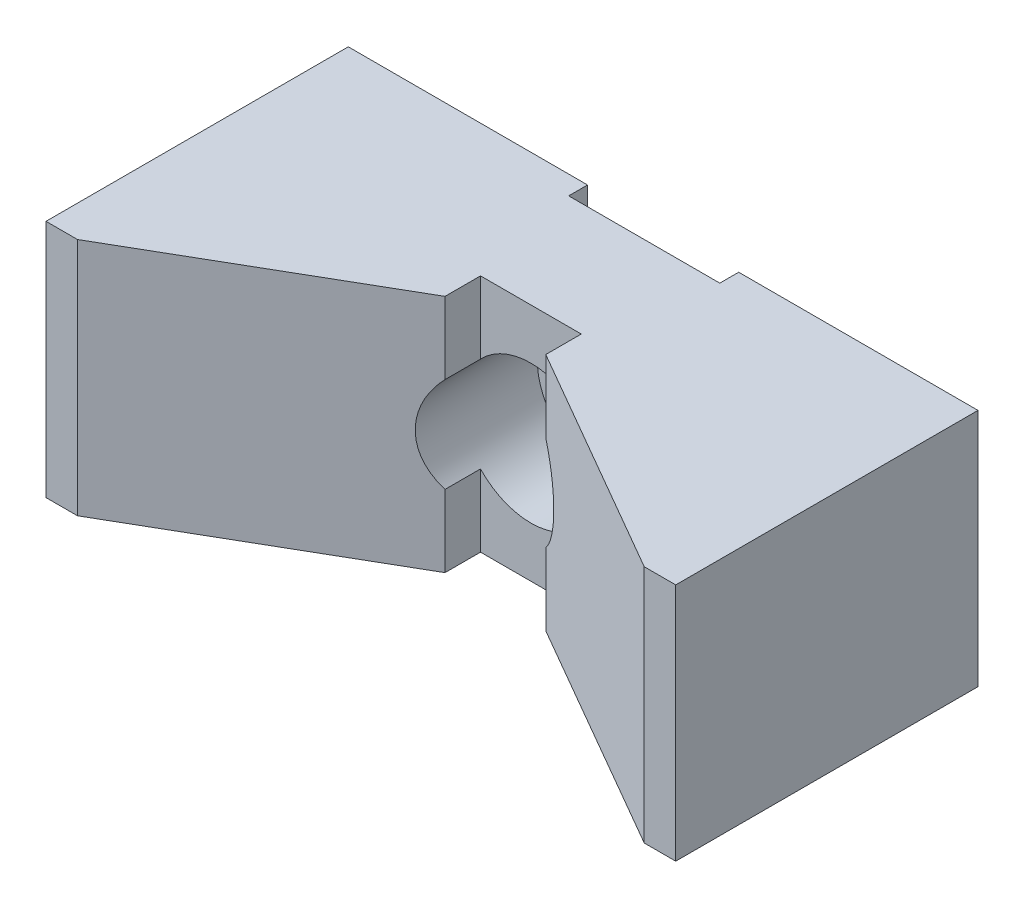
ISO-10303-21;
HEADER;
FILE_DESCRIPTION(('STEP AP214'),'2;1');
FILE_NAME('part.step','',(''),(''),'','','');
FILE_SCHEMA(('AUTOMOTIVE_DESIGN { 1 0 10303 214 1 1 1 1 }'));
ENDSEC;
DATA;
#1=APPLICATION_CONTEXT('core data for automotive mechanical design processes');
#2=APPLICATION_PROTOCOL_DEFINITION('international standard','automotive_design',2000,#1);
#3=PRODUCT_CONTEXT('',#1,'mechanical');
#4=PRODUCT('Part','Part','',(#3));
#5=PRODUCT_RELATED_PRODUCT_CATEGORY('part','',(#4));
#6=PRODUCT_DEFINITION_FORMATION('','',#4);
#7=PRODUCT_DEFINITION_CONTEXT('part definition',#1,'design');
#8=PRODUCT_DEFINITION('design','',#6,#7);
#9=PRODUCT_DEFINITION_SHAPE('','',#8);
#10=(LENGTH_UNIT() NAMED_UNIT(*) SI_UNIT(.MILLI.,.METRE.));
#11=(NAMED_UNIT(*) PLANE_ANGLE_UNIT() SI_UNIT($,.RADIAN.));
#12=(NAMED_UNIT(*) SI_UNIT($,.STERADIAN.) SOLID_ANGLE_UNIT());
#13=UNCERTAINTY_MEASURE_WITH_UNIT(LENGTH_MEASURE(1.E-05),#10,'distance_accuracy_value','');
#14=(GEOMETRIC_REPRESENTATION_CONTEXT(3) GLOBAL_UNCERTAINTY_ASSIGNED_CONTEXT((#13)) GLOBAL_UNIT_ASSIGNED_CONTEXT((#10,
#11,#12)) REPRESENTATION_CONTEXT('',''));
#15=CARTESIAN_POINT('',(0.,0.,0.));
#16=DIRECTION('',(0.,0.,1.));
#17=DIRECTION('',(1.,0.,0.));
#18=AXIS2_PLACEMENT_3D('',#15,#16,#17);
#19=CARTESIAN_POINT('',(-25.,-9.5,0.));
#20=DIRECTION('',(0.,0.,1.));
#21=DIRECTION('',(-1.,0.,0.));
#22=AXIS2_PLACEMENT_3D('',#19,#20,#21);
#23=PLANE('',#22);
#24=DIRECTION('',(1.,0.,0.));
#25=VECTOR('',#24,1.);
#26=CARTESIAN_POINT('',(-25.,-9.5,0.));
#27=LINE('',#26,#25);
#28=CARTESIAN_POINT('',(6.,-9.5,0.));
#29=VERTEX_POINT('',#28);
#30=CARTESIAN_POINT('',(25.,-9.5,0.));
#31=VERTEX_POINT('',#30);
#32=EDGE_CURVE('E238',#29,#31,#27,.T.);
#33=ORIENTED_EDGE('',*,*,#32,.F.);
#34=DIRECTION('',(0.,-1.,0.));
#35=VECTOR('',#34,1.);
#36=CARTESIAN_POINT('',(6.,29.5,0.));
#37=LINE('',#36,#35);
#38=CARTESIAN_POINT('',(6.,9.5,0.));
#39=VERTEX_POINT('',#38);
#40=EDGE_CURVE('E189',#39,#29,#37,.T.);
#41=ORIENTED_EDGE('',*,*,#40,.F.);
#42=DIRECTION('',(1.,0.,0.));
#43=VECTOR('',#42,1.);
#44=CARTESIAN_POINT('',(-25.,9.5,0.));
#45=LINE('',#44,#43);
#46=CARTESIAN_POINT('',(25.,9.5,0.));
#47=VERTEX_POINT('',#46);
#48=EDGE_CURVE('E222',#39,#47,#45,.T.);
#49=ORIENTED_EDGE('',*,*,#48,.T.);
#50=DIRECTION('',(0.,1.,0.));
#51=VECTOR('',#50,1.);
#52=CARTESIAN_POINT('',(25.,-9.5,0.));
#53=LINE('',#52,#51);
#54=EDGE_CURVE('E242',#31,#47,#53,.T.);
#55=ORIENTED_EDGE('',*,*,#54,.F.);
#56=EDGE_LOOP('',(#33,#41,#49,#55));
#57=FACE_BOUND('',#56,.T.);
#58=ADVANCED_FACE('F14',(#57),#23,.F.);
#59=CARTESIAN_POINT('',(25.,-9.5,0.));
#60=DIRECTION('',(-1.,0.,0.));
#61=DIRECTION('',(0.,0.,-1.));
#62=AXIS2_PLACEMENT_3D('',#59,#60,#61);
#63=PLANE('',#62);
#64=DIRECTION('',(0.,0.,1.));
#65=VECTOR('',#64,1.);
#66=CARTESIAN_POINT('',(25.,9.5,0.));
#67=LINE('',#66,#65);
#68=CARTESIAN_POINT('',(25.,9.5,24.));
#69=VERTEX_POINT('',#68);
#70=EDGE_CURVE('E208',#47,#69,#67,.T.);
#71=ORIENTED_EDGE('',*,*,#70,.T.);
#72=DIRECTION('',(0.,1.,0.));
#73=VECTOR('',#72,1.);
#74=CARTESIAN_POINT('',(25.,-9.5,24.));
#75=LINE('',#74,#73);
#76=CARTESIAN_POINT('',(25.,-9.5,24.));
#77=VERTEX_POINT('',#76);
#78=EDGE_CURVE('E257',#77,#69,#75,.T.);
#79=ORIENTED_EDGE('',*,*,#78,.F.);
#80=DIRECTION('',(0.,0.,1.));
#81=VECTOR('',#80,1.);
#82=CARTESIAN_POINT('',(25.,-9.5,0.));
#83=LINE('',#82,#81);
#84=EDGE_CURVE('E226',#31,#77,#83,.T.);
#85=ORIENTED_EDGE('',*,*,#84,.F.);
#86=ORIENTED_EDGE('',*,*,#54,.T.);
#87=EDGE_LOOP('',(#71,#79,#85,#86));
#88=FACE_BOUND('',#87,.T.);
#89=ADVANCED_FACE('F16',(#88),#63,.F.);
#90=CARTESIAN_POINT('',(25.,-9.5,24.));
#91=DIRECTION('',(0.,0.,-1.));
#92=DIRECTION('',(1.,0.,0.));
#93=AXIS2_PLACEMENT_3D('',#90,#91,#92);
#94=PLANE('',#93);
#95=DIRECTION('',(-1.,0.,0.));
#96=VECTOR('',#95,1.);
#97=CARTESIAN_POINT('',(25.,9.5,24.));
#98=LINE('',#97,#96);
#99=CARTESIAN_POINT('',(22.5,9.5,24.));
#100=VERTEX_POINT('',#99);
#101=EDGE_CURVE('E211',#69,#100,#98,.T.);
#102=ORIENTED_EDGE('',*,*,#101,.T.);
#103=DIRECTION('',(0.,1.,0.));
#104=VECTOR('',#103,1.);
#105=CARTESIAN_POINT('',(22.5,-9.5,24.));
#106=LINE('',#105,#104);
#107=CARTESIAN_POINT('',(22.5,-9.5,24.));
#108=VERTEX_POINT('',#107);
#109=EDGE_CURVE('E254',#108,#100,#106,.T.);
#110=ORIENTED_EDGE('',*,*,#109,.F.);
#111=DIRECTION('',(-1.,0.,0.));
#112=VECTOR('',#111,1.);
#113=CARTESIAN_POINT('',(25.,-9.5,24.));
#114=LINE('',#113,#112);
#115=EDGE_CURVE('E229',#77,#108,#114,.T.);
#116=ORIENTED_EDGE('',*,*,#115,.F.);
#117=ORIENTED_EDGE('',*,*,#78,.T.);
#118=EDGE_LOOP('',(#102,#110,#116,#117));
#119=FACE_BOUND('',#118,.T.);
#120=ADVANCED_FACE('F330',(#119),#94,.F.);
#121=CARTESIAN_POINT('',(22.5,-9.5,24.));
#122=DIRECTION('',(0.5,0.,-0.86602540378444));
#123=DIRECTION('',(0.86602540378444,0.,0.5));
#124=AXIS2_PLACEMENT_3D('',#121,#122,#123);
#125=PLANE('',#124);
#126=DIRECTION('',(-0.86602540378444,0.,-0.5));
#127=VECTOR('',#126,1.);
#128=CARTESIAN_POINT('',(22.5,9.5,24.));
#129=LINE('',#128,#127);
#130=CARTESIAN_POINT('',(4.,9.5,13.319020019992));
#131=VERTEX_POINT('',#130);
#132=EDGE_CURVE('E213',#100,#131,#129,.T.);
#133=ORIENTED_EDGE('',*,*,#132,.T.);
#134=DIRECTION('',(0.,-1.,0.));
#135=VECTOR('',#134,1.);
#136=CARTESIAN_POINT('',(4.,-9.5,13.319020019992));
#137=LINE('',#136,#135);
#138=CARTESIAN_POINT('',(4.,3.77491721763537,13.319020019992));
#139=VERTEX_POINT('',#138);
#140=EDGE_CURVE('E165',#131,#139,#137,.T.);
#141=ORIENTED_EDGE('',*,*,#140,.T.);
#142=CARTESIAN_POINT('',(0.,0.,11.0096189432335));
#143=DIRECTION('',(0.5,0.,-0.86602540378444));
#144=DIRECTION('',(-0.86602540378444,0.,-0.5));
#145=AXIS2_PLACEMENT_3D('',#142,#143,#144);
#146=ELLIPSE('',#145,6.35085296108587,5.5);
#147=CARTESIAN_POINT('',(4.,-3.77491721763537,13.319020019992));
#148=VERTEX_POINT('',#147);
#149=EDGE_CURVE('E185',#139,#148,#146,.T.);
#150=ORIENTED_EDGE('',*,*,#149,.T.);
#151=CARTESIAN_POINT('',(4.,-9.5,13.319020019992));
#152=VERTEX_POINT('',#151);
#153=EDGE_CURVE('E37',#148,#152,#137,.T.);
#154=ORIENTED_EDGE('',*,*,#153,.T.);
#155=DIRECTION('',(-0.86602540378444,0.,-0.5));
#156=VECTOR('',#155,1.);
#157=CARTESIAN_POINT('',(22.5,-9.5,24.));
#158=LINE('',#157,#156);
#159=EDGE_CURVE('E159',#108,#152,#158,.T.);
#160=ORIENTED_EDGE('',*,*,#159,.F.);
#161=ORIENTED_EDGE('',*,*,#109,.T.);
#162=EDGE_LOOP('',(#133,#141,#150,#154,#160,#161));
#163=FACE_BOUND('',#162,.T.);
#164=ADVANCED_FACE('F333',(#163),#125,.F.);
#165=CARTESIAN_POINT('',(-22.5,-9.5,24.));
#166=DIRECTION('',(-0.5,0.,-0.86602540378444));
#167=DIRECTION('',(0.86602540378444,0.,-0.5));
#168=AXIS2_PLACEMENT_3D('',#165,#166,#167);
#169=PLANE('',#168);
#170=DIRECTION('',(-0.86602540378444,0.,0.5));
#171=VECTOR('',#170,1.);
#172=CARTESIAN_POINT('',(-22.5,-9.5,24.));
#173=LINE('',#172,#171);
#174=CARTESIAN_POINT('',(-4.,-9.5,13.319020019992));
#175=VERTEX_POINT('',#174);
#176=CARTESIAN_POINT('',(-22.5,-9.5,24.));
#177=VERTEX_POINT('',#176);
#178=EDGE_CURVE('E232',#175,#177,#173,.T.);
#179=ORIENTED_EDGE('',*,*,#178,.F.);
#180=DIRECTION('',(0.,1.,0.));
#181=VECTOR('',#180,1.);
#182=CARTESIAN_POINT('',(-4.,-9.5,13.319020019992));
#183=LINE('',#182,#181);
#184=CARTESIAN_POINT('',(-4.,-3.77491721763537,13.319020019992));
#185=VERTEX_POINT('',#184);
#186=EDGE_CURVE('E170',#175,#185,#183,.T.);
#187=ORIENTED_EDGE('',*,*,#186,.T.);
#188=CARTESIAN_POINT('',(0.,0.,11.0096189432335));
#189=DIRECTION('',(-0.5,0.,-0.86602540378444));
#190=DIRECTION('',(0.86602540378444,0.,-0.5));
#191=AXIS2_PLACEMENT_3D('',#188,#189,#190);
#192=ELLIPSE('',#191,6.35085296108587,5.5);
#193=CARTESIAN_POINT('',(-4.,3.77491721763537,13.319020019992));
#194=VERTEX_POINT('',#193);
#195=EDGE_CURVE('E267',#185,#194,#192,.T.);
#196=ORIENTED_EDGE('',*,*,#195,.T.);
#197=CARTESIAN_POINT('',(-4.,9.5,13.319020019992));
#198=VERTEX_POINT('',#197);
#199=EDGE_CURVE('E173',#194,#198,#183,.T.);
#200=ORIENTED_EDGE('',*,*,#199,.T.);
#201=DIRECTION('',(-0.86602540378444,0.,0.5));
#202=VECTOR('',#201,1.);
#203=CARTESIAN_POINT('',(-22.5,9.5,24.));
#204=LINE('',#203,#202);
#205=CARTESIAN_POINT('',(-22.5,9.5,24.));
#206=VERTEX_POINT('',#205);
#207=EDGE_CURVE('E216',#198,#206,#204,.T.);
#208=ORIENTED_EDGE('',*,*,#207,.T.);
#209=DIRECTION('',(0.,1.,0.));
#210=VECTOR('',#209,1.);
#211=CARTESIAN_POINT('',(-22.5,-9.5,24.));
#212=LINE('',#211,#210);
#213=EDGE_CURVE('E251',#177,#206,#212,.T.);
#214=ORIENTED_EDGE('',*,*,#213,.F.);
#215=EDGE_LOOP('',(#179,#187,#196,#200,#208,#214));
#216=FACE_BOUND('',#215,.T.);
#217=ADVANCED_FACE('F289',(#216),#169,.F.);
#218=CARTESIAN_POINT('',(-25.,-9.5,24.));
#219=DIRECTION('',(0.,0.,-1.));
#220=DIRECTION('',(1.,0.,0.));
#221=AXIS2_PLACEMENT_3D('',#218,#219,#220);
#222=PLANE('',#221);
#223=DIRECTION('',(-1.,0.,0.));
#224=VECTOR('',#223,1.);
#225=CARTESIAN_POINT('',(-25.,9.5,24.));
#226=LINE('',#225,#224);
#227=CARTESIAN_POINT('',(-25.,9.5,24.));
#228=VERTEX_POINT('',#227);
#229=EDGE_CURVE('E218',#206,#228,#226,.T.);
#230=ORIENTED_EDGE('',*,*,#229,.T.);
#231=DIRECTION('',(0.,1.,0.));
#232=VECTOR('',#231,1.);
#233=CARTESIAN_POINT('',(-25.,-9.5,24.));
#234=LINE('',#233,#232);
#235=CARTESIAN_POINT('',(-25.,-9.5,24.));
#236=VERTEX_POINT('',#235);
#237=EDGE_CURVE('E248',#236,#228,#234,.T.);
#238=ORIENTED_EDGE('',*,*,#237,.F.);
#239=DIRECTION('',(-1.,0.,0.));
#240=VECTOR('',#239,1.);
#241=CARTESIAN_POINT('',(-25.,-9.5,24.));
#242=LINE('',#241,#240);
#243=EDGE_CURVE('E234',#177,#236,#242,.T.);
#244=ORIENTED_EDGE('',*,*,#243,.F.);
#245=ORIENTED_EDGE('',*,*,#213,.T.);
#246=EDGE_LOOP('',(#230,#238,#244,#245));
#247=FACE_BOUND('',#246,.T.);
#248=ADVANCED_FACE('F296',(#247),#222,.F.);
#249=CARTESIAN_POINT('',(-25.,-9.5,0.));
#250=DIRECTION('',(1.,0.,0.));
#251=DIRECTION('',(0.,0.,1.));
#252=AXIS2_PLACEMENT_3D('',#249,#250,#251);
#253=PLANE('',#252);
#254=DIRECTION('',(0.,0.,-1.));
#255=VECTOR('',#254,1.);
#256=CARTESIAN_POINT('',(-25.,9.5,0.));
#257=LINE('',#256,#255);
#258=CARTESIAN_POINT('',(-25.,9.5,0.));
#259=VERTEX_POINT('',#258);
#260=EDGE_CURVE('E220',#228,#259,#257,.T.);
#261=ORIENTED_EDGE('',*,*,#260,.T.);
#262=DIRECTION('',(0.,1.,0.));
#263=VECTOR('',#262,1.);
#264=CARTESIAN_POINT('',(-25.,-9.5,0.));
#265=LINE('',#264,#263);
#266=CARTESIAN_POINT('',(-25.,-9.5,0.));
#267=VERTEX_POINT('',#266);
#268=EDGE_CURVE('E245',#267,#259,#265,.T.);
#269=ORIENTED_EDGE('',*,*,#268,.F.);
#270=DIRECTION('',(0.,0.,-1.));
#271=VECTOR('',#270,1.);
#272=CARTESIAN_POINT('',(-25.,-9.5,0.));
#273=LINE('',#272,#271);
#274=EDGE_CURVE('E236',#236,#267,#273,.T.);
#275=ORIENTED_EDGE('',*,*,#274,.F.);
#276=ORIENTED_EDGE('',*,*,#237,.T.);
#277=EDGE_LOOP('',(#261,#269,#275,#276));
#278=FACE_BOUND('',#277,.T.);
#279=ADVANCED_FACE('F301',(#278),#253,.F.);
#280=CARTESIAN_POINT('',(-6.,9.5,0.));
#281=VERTEX_POINT('',#280);
#282=EDGE_CURVE('E223',#259,#281,#45,.T.);
#283=ORIENTED_EDGE('',*,*,#282,.T.);
#284=DIRECTION('',(0.,-1.,0.));
#285=VECTOR('',#284,1.);
#286=CARTESIAN_POINT('',(-6.,29.5,0.));
#287=LINE('',#286,#285);
#288=CARTESIAN_POINT('',(-6.,-9.5,0.));
#289=VERTEX_POINT('',#288);
#290=EDGE_CURVE('E192',#281,#289,#287,.T.);
#291=ORIENTED_EDGE('',*,*,#290,.T.);
#292=EDGE_CURVE('E239',#267,#289,#27,.T.);
#293=ORIENTED_EDGE('',*,*,#292,.F.);
#294=ORIENTED_EDGE('',*,*,#268,.T.);
#295=EDGE_LOOP('',(#283,#291,#293,#294));
#296=FACE_BOUND('',#295,.T.);
#297=ADVANCED_FACE('F305',(#296),#23,.F.);
#298=CARTESIAN_POINT('',(25.,-9.5,0.));
#299=DIRECTION('',(0.,1.,0.));
#300=DIRECTION('',(1.,0.,0.));
#301=AXIS2_PLACEMENT_3D('',#298,#299,#300);
#302=PLANE('',#301);
#303=DIRECTION('',(1.,0.,0.));
#304=VECTOR('',#303,1.);
#305=CARTESIAN_POINT('',(4.,-9.5,10.5));
#306=LINE('',#305,#304);
#307=CARTESIAN_POINT('',(-4.,-9.5,10.5));
#308=VERTEX_POINT('',#307);
#309=CARTESIAN_POINT('',(4.,-9.5,10.5));
#310=VERTEX_POINT('',#309);
#311=EDGE_CURVE('E148',#308,#310,#306,.T.);
#312=ORIENTED_EDGE('',*,*,#311,.F.);
#313=DIRECTION('',(0.,0.,-1.));
#314=VECTOR('',#313,1.);
#315=CARTESIAN_POINT('',(-4.,-9.5,10.5));
#316=LINE('',#315,#314);
#317=EDGE_CURVE('E145',#175,#308,#316,.T.);
#318=ORIENTED_EDGE('',*,*,#317,.F.);
#319=ORIENTED_EDGE('',*,*,#178,.T.);
#320=ORIENTED_EDGE('',*,*,#243,.T.);
#321=ORIENTED_EDGE('',*,*,#274,.T.);
#322=ORIENTED_EDGE('',*,*,#292,.T.);
#323=DIRECTION('',(0.,0.,1.));
#324=VECTOR('',#323,1.);
#325=CARTESIAN_POINT('',(-6.,-9.5,0.));
#326=LINE('',#325,#324);
#327=CARTESIAN_POINT('',(-6.,-9.5,1.5));
#328=VERTEX_POINT('',#327);
#329=EDGE_CURVE('E202',#289,#328,#326,.T.);
#330=ORIENTED_EDGE('',*,*,#329,.T.);
#331=DIRECTION('',(1.,0.,0.));
#332=VECTOR('',#331,1.);
#333=CARTESIAN_POINT('',(25.,-9.5,1.5));
#334=LINE('',#333,#332);
#335=CARTESIAN_POINT('',(6.,-9.5,1.5));
#336=VERTEX_POINT('',#335);
#337=EDGE_CURVE('E191',#328,#336,#334,.T.);
#338=ORIENTED_EDGE('',*,*,#337,.T.);
#339=DIRECTION('',(0.,0.,-1.));
#340=VECTOR('',#339,1.);
#341=CARTESIAN_POINT('',(6.,-9.5,0.));
#342=LINE('',#341,#340);
#343=EDGE_CURVE('E205',#336,#29,#342,.T.);
#344=ORIENTED_EDGE('',*,*,#343,.T.);
#345=ORIENTED_EDGE('',*,*,#32,.T.);
#346=ORIENTED_EDGE('',*,*,#84,.T.);
#347=ORIENTED_EDGE('',*,*,#115,.T.);
#348=ORIENTED_EDGE('',*,*,#159,.T.);
#349=DIRECTION('',(0.,0.,1.));
#350=VECTOR('',#349,1.);
#351=CARTESIAN_POINT('',(4.,-9.5,10.5));
#352=LINE('',#351,#350);
#353=EDGE_CURVE('E141',#310,#152,#352,.T.);
#354=ORIENTED_EDGE('',*,*,#353,.F.);
#355=EDGE_LOOP('',(#312,#318,#319,#320,#321,#322,#330,#338,#344,#345,#346,#347,#348,#354));
#356=FACE_BOUND('',#355,.T.);
#357=ADVANCED_FACE('F157',(#356),#302,.F.);
#358=CARTESIAN_POINT('',(25.,9.5,0.));
#359=DIRECTION('',(0.,1.,0.));
#360=DIRECTION('',(1.,0.,0.));
#361=AXIS2_PLACEMENT_3D('',#358,#359,#360);
#362=PLANE('',#361);
#363=DIRECTION('',(0.,0.,1.));
#364=VECTOR('',#363,1.);
#365=CARTESIAN_POINT('',(-4.,9.5,0.));
#366=LINE('',#365,#364);
#367=CARTESIAN_POINT('',(-4.,9.5,10.5));
#368=VERTEX_POINT('',#367);
#369=EDGE_CURVE('E174',#368,#198,#366,.T.);
#370=ORIENTED_EDGE('',*,*,#369,.F.);
#371=DIRECTION('',(-1.,0.,0.));
#372=VECTOR('',#371,1.);
#373=CARTESIAN_POINT('',(25.,9.5,10.5));
#374=LINE('',#373,#372);
#375=CARTESIAN_POINT('',(4.,9.5,10.5));
#376=VERTEX_POINT('',#375);
#377=EDGE_CURVE('E176',#376,#368,#374,.T.);
#378=ORIENTED_EDGE('',*,*,#377,.F.);
#379=DIRECTION('',(0.,0.,-1.));
#380=VECTOR('',#379,1.);
#381=CARTESIAN_POINT('',(4.,9.5,0.));
#382=LINE('',#381,#380);
#383=EDGE_CURVE('E168',#131,#376,#382,.T.);
#384=ORIENTED_EDGE('',*,*,#383,.F.);
#385=ORIENTED_EDGE('',*,*,#132,.F.);
#386=ORIENTED_EDGE('',*,*,#101,.F.);
#387=ORIENTED_EDGE('',*,*,#70,.F.);
#388=ORIENTED_EDGE('',*,*,#48,.F.);
#389=DIRECTION('',(0.,0.,-1.));
#390=VECTOR('',#389,1.);
#391=CARTESIAN_POINT('',(6.,9.5,0.));
#392=LINE('',#391,#390);
#393=CARTESIAN_POINT('',(6.,9.5,1.5));
#394=VERTEX_POINT('',#393);
#395=EDGE_CURVE('E265',#394,#39,#392,.T.);
#396=ORIENTED_EDGE('',*,*,#395,.F.);
#397=DIRECTION('',(1.,0.,0.));
#398=VECTOR('',#397,1.);
#399=CARTESIAN_POINT('',(25.,9.5,1.5));
#400=LINE('',#399,#398);
#401=CARTESIAN_POINT('',(-6.,9.5,1.5));
#402=VERTEX_POINT('',#401);
#403=EDGE_CURVE('E260',#402,#394,#400,.T.);
#404=ORIENTED_EDGE('',*,*,#403,.F.);
#405=DIRECTION('',(0.,0.,1.));
#406=VECTOR('',#405,1.);
#407=CARTESIAN_POINT('',(-6.,9.5,0.));
#408=LINE('',#407,#406);
#409=EDGE_CURVE('E262',#281,#402,#408,.T.);
#410=ORIENTED_EDGE('',*,*,#409,.F.);
#411=ORIENTED_EDGE('',*,*,#282,.F.);
#412=ORIENTED_EDGE('',*,*,#260,.F.);
#413=ORIENTED_EDGE('',*,*,#229,.F.);
#414=ORIENTED_EDGE('',*,*,#207,.F.);
#415=EDGE_LOOP('',(#370,#378,#384,#385,#386,#387,#388,#396,#404,#410,#411,#412,#413,#414));
#416=FACE_BOUND('',#415,.T.);
#417=ADVANCED_FACE('F312',(#416),#362,.T.);
#418=CARTESIAN_POINT('',(6.,29.5,0.));
#419=DIRECTION('',(1.,0.,0.));
#420=DIRECTION('',(0.,0.,1.));
#421=AXIS2_PLACEMENT_3D('',#418,#419,#420);
#422=PLANE('',#421);
#423=DIRECTION('',(0.,-1.,0.));
#424=VECTOR('',#423,1.);
#425=CARTESIAN_POINT('',(6.,29.5,1.5));
#426=LINE('',#425,#424);
#427=EDGE_CURVE('E188',#394,#336,#426,.T.);
#428=ORIENTED_EDGE('',*,*,#427,.F.);
#429=ORIENTED_EDGE('',*,*,#395,.T.);
#430=ORIENTED_EDGE('',*,*,#40,.T.);
#431=ORIENTED_EDGE('',*,*,#343,.F.);
#432=EDGE_LOOP('',(#428,#429,#430,#431));
#433=FACE_BOUND('',#432,.T.);
#434=ADVANCED_FACE('F319',(#433),#422,.F.);
#435=CARTESIAN_POINT('',(-6.,29.5,0.));
#436=DIRECTION('',(-1.,0.,0.));
#437=DIRECTION('',(0.,0.,-1.));
#438=AXIS2_PLACEMENT_3D('',#435,#436,#437);
#439=PLANE('',#438);
#440=ORIENTED_EDGE('',*,*,#290,.F.);
#441=ORIENTED_EDGE('',*,*,#409,.T.);
#442=DIRECTION('',(0.,-1.,0.));
#443=VECTOR('',#442,1.);
#444=CARTESIAN_POINT('',(-6.,29.5,1.5));
#445=LINE('',#444,#443);
#446=EDGE_CURVE('E195',#402,#328,#445,.T.);
#447=ORIENTED_EDGE('',*,*,#446,.T.);
#448=ORIENTED_EDGE('',*,*,#329,.F.);
#449=EDGE_LOOP('',(#440,#441,#447,#448));
#450=FACE_BOUND('',#449,.T.);
#451=ADVANCED_FACE('F308',(#450),#439,.F.);
#452=CARTESIAN_POINT('',(6.,29.5,1.5));
#453=DIRECTION('',(0.,0.,1.));
#454=DIRECTION('',(-1.,0.,0.));
#455=AXIS2_PLACEMENT_3D('',#452,#453,#454);
#456=PLANE('',#455);
#457=CARTESIAN_POINT('',(0.,0.,1.5));
#458=DIRECTION('',(0.,0.,-1.));
#459=DIRECTION('',(0.,-1.,0.));
#460=AXIS2_PLACEMENT_3D('',#457,#458,#459);
#461=CIRCLE('',#460,3.25);
#462=CARTESIAN_POINT('',(0.,-3.25,1.5));
#463=VERTEX_POINT('',#462);
#464=EDGE_CURVE('E178',#463,#463,#461,.T.);
#465=ORIENTED_EDGE('',*,*,#464,.F.);
#466=EDGE_LOOP('',(#465));
#467=FACE_BOUND('',#466,.T.);
#468=ORIENTED_EDGE('',*,*,#446,.F.);
#469=ORIENTED_EDGE('',*,*,#403,.T.);
#470=ORIENTED_EDGE('',*,*,#427,.T.);
#471=ORIENTED_EDGE('',*,*,#337,.F.);
#472=EDGE_LOOP('',(#468,#469,#470,#471));
#473=FACE_BOUND('',#472,.T.);
#474=ADVANCED_FACE('F317',(#467,#473),#456,.F.);
#475=CARTESIAN_POINT('',(0.,0.,24.));
#476=DIRECTION('',(0.,0.,-1.));
#477=DIRECTION('',(1.,0.,0.));
#478=AXIS2_PLACEMENT_3D('',#475,#476,#477);
#479=CYLINDRICAL_SURFACE('',#478,5.5);
#480=CARTESIAN_POINT('',(0.,0.,4.5));
#481=DIRECTION('',(0.,0.,-1.));
#482=DIRECTION('',(1.,0.,0.));
#483=AXIS2_PLACEMENT_3D('',#480,#481,#482);
#484=CIRCLE('',#483,5.5);
#485=CARTESIAN_POINT('',(5.5,0.,4.5));
#486=VERTEX_POINT('',#485);
#487=EDGE_CURVE('E182',#486,#486,#484,.T.);
#488=ORIENTED_EDGE('',*,*,#487,.T.);
#489=EDGE_LOOP('',(#488));
#490=FACE_BOUND('',#489,.T.);
#491=ORIENTED_EDGE('',*,*,#195,.F.);
#492=DIRECTION('',(0.,0.,-1.));
#493=VECTOR('',#492,1.);
#494=CARTESIAN_POINT('',(-4.,-3.77491721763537,24.));
#495=LINE('',#494,#493);
#496=CARTESIAN_POINT('',(-4.,-3.77491721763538,10.5));
#497=VERTEX_POINT('',#496);
#498=EDGE_CURVE('E9',#185,#497,#495,.T.);
#499=ORIENTED_EDGE('',*,*,#498,.T.);
#500=CARTESIAN_POINT('',(0.,0.,10.5));
#501=DIRECTION('',(0.,0.,-1.));
#502=DIRECTION('',(1.,0.,0.));
#503=AXIS2_PLACEMENT_3D('',#500,#501,#502);
#504=CIRCLE('',#503,5.5);
#505=CARTESIAN_POINT('',(4.,-3.77491721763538,10.5));
#506=VERTEX_POINT('',#505);
#507=EDGE_CURVE('E22',#497,#506,#504,.F.);
#508=ORIENTED_EDGE('',*,*,#507,.T.);
#509=DIRECTION('',(0.,0.,-1.));
#510=VECTOR('',#509,1.);
#511=CARTESIAN_POINT('',(4.,-3.77491721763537,24.));
#512=LINE('',#511,#510);
#513=EDGE_CURVE('E142',#506,#148,#512,.F.);
#514=ORIENTED_EDGE('',*,*,#513,.T.);
#515=ORIENTED_EDGE('',*,*,#149,.F.);
#516=DIRECTION('',(0.,0.,-1.));
#517=VECTOR('',#516,1.);
#518=CARTESIAN_POINT('',(4.,3.77491721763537,24.));
#519=LINE('',#518,#517);
#520=CARTESIAN_POINT('',(4.,3.77491721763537,10.5));
#521=VERTEX_POINT('',#520);
#522=EDGE_CURVE('E270',#139,#521,#519,.T.);
#523=ORIENTED_EDGE('',*,*,#522,.T.);
#524=CARTESIAN_POINT('',(-4.,3.77491721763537,10.5));
#525=VERTEX_POINT('',#524);
#526=EDGE_CURVE('E275',#521,#525,#504,.F.);
#527=ORIENTED_EDGE('',*,*,#526,.T.);
#528=DIRECTION('',(0.,0.,-1.));
#529=VECTOR('',#528,1.);
#530=CARTESIAN_POINT('',(-4.,3.77491721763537,24.));
#531=LINE('',#530,#529);
#532=EDGE_CURVE('E278',#525,#194,#531,.F.);
#533=ORIENTED_EDGE('',*,*,#532,.T.);
#534=EDGE_LOOP('',(#491,#499,#508,#514,#515,#523,#527,#533));
#535=FACE_BOUND('',#534,.T.);
#536=ADVANCED_FACE('F283',(#490,#535),#479,.F.);
#537=CARTESIAN_POINT('',(0.,0.,4.5));
#538=DIRECTION('',(0.,0.,-1.));
#539=DIRECTION('',(1.,0.,0.));
#540=AXIS2_PLACEMENT_3D('',#537,#538,#539);
#541=PLANE('',#540);
#542=CARTESIAN_POINT('',(0.,0.,4.5));
#543=DIRECTION('',(0.,0.,-1.));
#544=DIRECTION('',(1.,0.,0.));
#545=AXIS2_PLACEMENT_3D('',#542,#543,#544);
#546=CIRCLE('',#545,3.25);
#547=CARTESIAN_POINT('',(3.25,0.,4.5));
#548=VERTEX_POINT('',#547);
#549=EDGE_CURVE('E181',#548,#548,#546,.T.);
#550=ORIENTED_EDGE('',*,*,#549,.T.);
#551=EDGE_LOOP('',(#550));
#552=FACE_BOUND('',#551,.T.);
#553=ORIENTED_EDGE('',*,*,#487,.F.);
#554=EDGE_LOOP('',(#553));
#555=FACE_BOUND('',#554,.T.);
#556=ADVANCED_FACE('F353',(#552,#555),#541,.F.);
#557=CARTESIAN_POINT('',(0.,0.,24.));
#558=DIRECTION('',(0.,0.,-1.));
#559=DIRECTION('',(0.,-1.,0.));
#560=AXIS2_PLACEMENT_3D('',#557,#558,#559);
#561=CYLINDRICAL_SURFACE('',#560,3.25);
#562=ORIENTED_EDGE('',*,*,#464,.T.);
#563=EDGE_LOOP('',(#562));
#564=FACE_BOUND('',#563,.T.);
#565=ORIENTED_EDGE('',*,*,#549,.F.);
#566=EDGE_LOOP('',(#565));
#567=FACE_BOUND('',#566,.T.);
#568=ADVANCED_FACE('F344',(#564,#567),#561,.F.);
#569=CARTESIAN_POINT('',(-4.,30.5,10.5));
#570=DIRECTION('',(-1.,0.,0.));
#571=DIRECTION('',(0.,0.,-1.));
#572=AXIS2_PLACEMENT_3D('',#569,#570,#571);
#573=PLANE('',#572);
#574=ORIENTED_EDGE('',*,*,#369,.T.);
#575=ORIENTED_EDGE('',*,*,#199,.F.);
#576=ORIENTED_EDGE('',*,*,#532,.F.);
#577=DIRECTION('',(0.,-1.,0.));
#578=VECTOR('',#577,1.);
#579=CARTESIAN_POINT('',(-4.,30.5,10.5));
#580=LINE('',#579,#578);
#581=EDGE_CURVE('E163',#368,#525,#580,.T.);
#582=ORIENTED_EDGE('',*,*,#581,.F.);
#583=EDGE_LOOP('',(#574,#575,#576,#582));
#584=FACE_BOUND('',#583,.T.);
#585=ADVANCED_FACE('F342',(#584),#573,.F.);
#586=CARTESIAN_POINT('',(4.,30.5,10.5));
#587=DIRECTION('',(1.,0.,0.));
#588=DIRECTION('',(0.,0.,1.));
#589=AXIS2_PLACEMENT_3D('',#586,#587,#588);
#590=PLANE('',#589);
#591=ORIENTED_EDGE('',*,*,#383,.T.);
#592=DIRECTION('',(0.,-1.,0.));
#593=VECTOR('',#592,1.);
#594=CARTESIAN_POINT('',(4.,30.5,10.5));
#595=LINE('',#594,#593);
#596=EDGE_CURVE('E29',#376,#521,#595,.T.);
#597=ORIENTED_EDGE('',*,*,#596,.T.);
#598=ORIENTED_EDGE('',*,*,#522,.F.);
#599=ORIENTED_EDGE('',*,*,#140,.F.);
#600=EDGE_LOOP('',(#591,#597,#598,#599));
#601=FACE_BOUND('',#600,.T.);
#602=ADVANCED_FACE('F334',(#601),#590,.F.);
#603=CARTESIAN_POINT('',(4.,30.5,10.5));
#604=DIRECTION('',(0.,0.,-1.));
#605=DIRECTION('',(1.,0.,0.));
#606=AXIS2_PLACEMENT_3D('',#603,#604,#605);
#607=PLANE('',#606);
#608=ORIENTED_EDGE('',*,*,#377,.T.);
#609=ORIENTED_EDGE('',*,*,#581,.T.);
#610=ORIENTED_EDGE('',*,*,#526,.F.);
#611=ORIENTED_EDGE('',*,*,#596,.F.);
#612=EDGE_LOOP('',(#608,#609,#610,#611));
#613=FACE_BOUND('',#612,.T.);
#614=ADVANCED_FACE('F340',(#613),#607,.F.);
#615=EDGE_CURVE('E151',#497,#308,#580,.T.);
#616=ORIENTED_EDGE('',*,*,#615,.T.);
#617=ORIENTED_EDGE('',*,*,#311,.T.);
#618=EDGE_CURVE('E137',#506,#310,#595,.T.);
#619=ORIENTED_EDGE('',*,*,#618,.F.);
#620=ORIENTED_EDGE('',*,*,#507,.F.);
#621=EDGE_LOOP('',(#616,#617,#619,#620));
#622=FACE_BOUND('',#621,.T.);
#623=ADVANCED_FACE('F149',(#622),#607,.F.);
#624=ORIENTED_EDGE('',*,*,#317,.T.);
#625=ORIENTED_EDGE('',*,*,#615,.F.);
#626=ORIENTED_EDGE('',*,*,#498,.F.);
#627=ORIENTED_EDGE('',*,*,#186,.F.);
#628=EDGE_LOOP('',(#624,#625,#626,#627));
#629=FACE_BOUND('',#628,.T.);
#630=ADVANCED_FACE('F285',(#629),#573,.F.);
#631=ORIENTED_EDGE('',*,*,#513,.F.);
#632=ORIENTED_EDGE('',*,*,#618,.T.);
#633=ORIENTED_EDGE('',*,*,#353,.T.);
#634=ORIENTED_EDGE('',*,*,#153,.F.);
#635=EDGE_LOOP('',(#631,#632,#633,#634));
#636=FACE_BOUND('',#635,.T.);
#637=ADVANCED_FACE('F139',(#636),#590,.F.);
#638=CLOSED_SHELL('',(#58,#89,#120,#164,#217,#248,#279,#297,#357,#417,#434,#451,#474,#536,#556,
#568,#585,#602,#614,#623,#630,#637));
#639=MANIFOLD_SOLID_BREP('B1',#638);
#640=ADVANCED_BREP_SHAPE_REPRESENTATION('',(#18,#639),#14);
#641=SHAPE_DEFINITION_REPRESENTATION(#9,#640);
ENDSEC;
END-ISO-10303-21;
